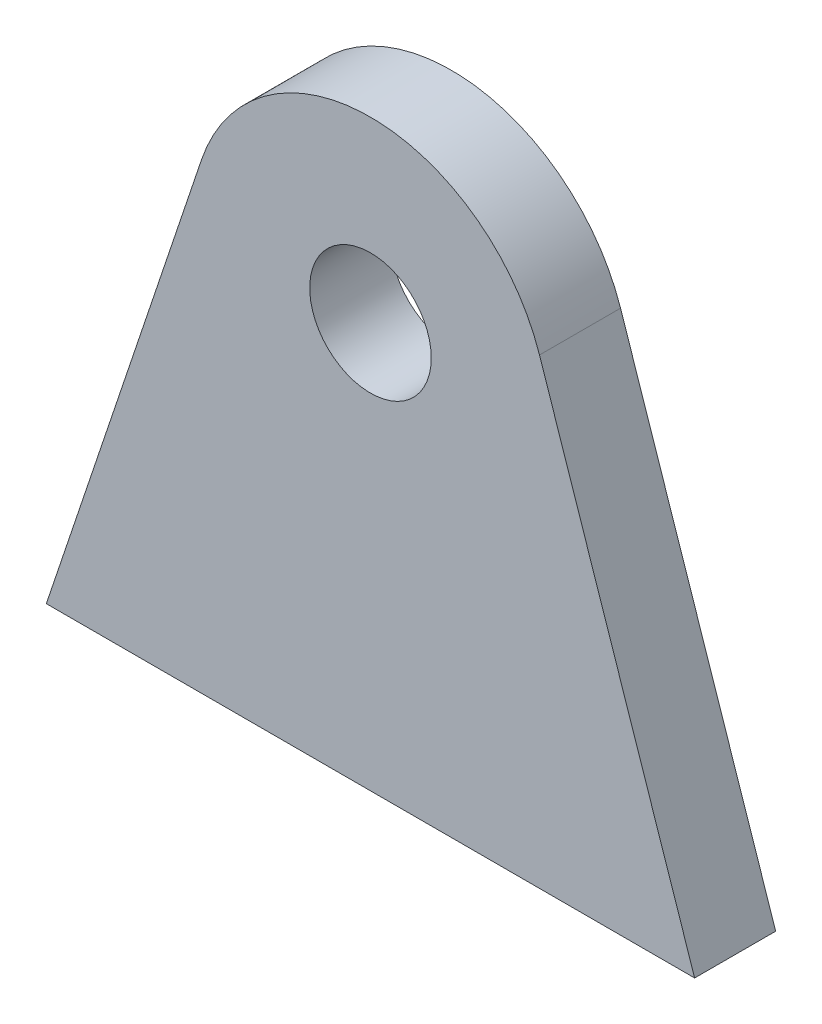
from build123d import *

# Parameters (mm, degrees)
SKETCH1_R           = 4.7625
BOSS_EXTRUDE1_DEPTH = 6.35


with BuildPart() as part:
    # Sketch1 → Boss-Extrude1 (new body)
    with BuildSketch(Plane.XY):
        with BuildLine():
            Line((0, 0), (12.156919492, 36.197664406))
            ThreePointArc((12.156919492, 36.197664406), (25.4, 45.72), (38.643080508, 36.197664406))
            Line((38.643080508, 36.197664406), (50.8, 0))
            Line((50.8, 0), (0, 0))
        make_face()
        with Locations((25.4, 31.75)):
            Circle(SKETCH1_R, mode=Mode.SUBTRACT)
    extrude(amount=BOSS_EXTRUDE1_DEPTH)


solid = part.part
